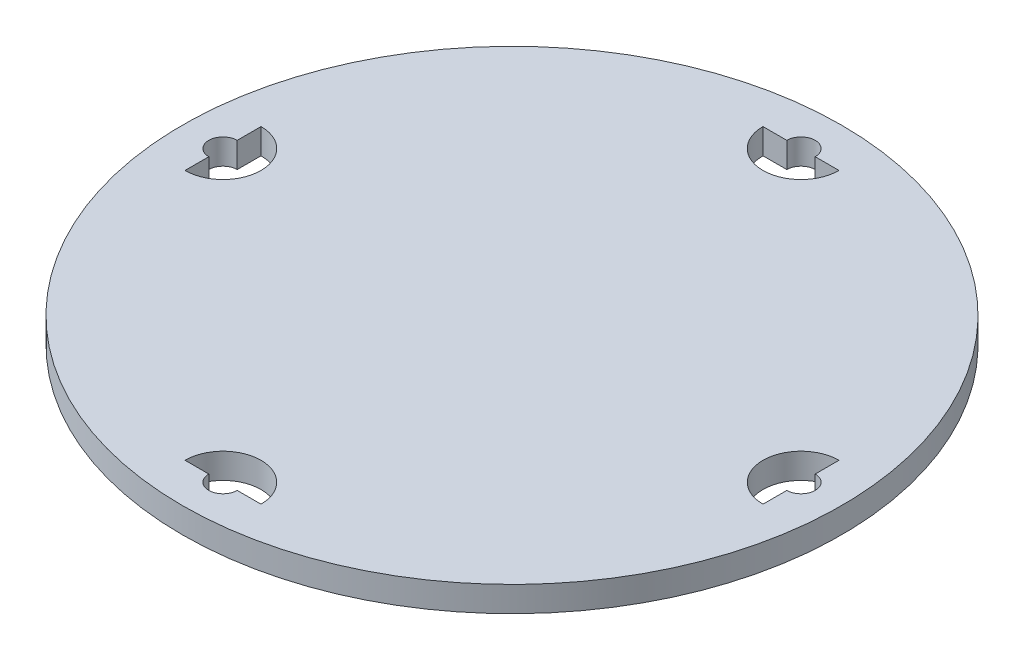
from build123d import *

# Parameters (mm, degrees)
SKETCH2_R           = 82.55
BOSS_EXTRUDE1_DEPTH = 6.35
CUT_EXTRUDE2_REACH  = 118.916
CIRPATTERN1_COUNT   = 4


with BuildPart() as part:
    # Sketch2 → Boss-Extrude1 (new body)
    with BuildSketch(Plane(origin=(0, 0, 0), x_dir=(1, 0, 0), z_dir=(0, 1, 0))):
        with Locations(Location((0, 0, 0), (0, 0, 270))):
            Circle(SKETCH2_R)
    extrude(amount=BOSS_EXTRUDE1_DEPTH)

    # Sketch3 → Cut-Extrude2 (cut, up to next)
    with BuildSketch(Plane(origin=(0, 0, 0), x_dir=(1, 0, 0), z_dir=(0, 1, 0)), mode=Mode.PRIVATE) as cut_extrude2_sk1:
        with BuildLine():
            Line((-9.525, -72.39), (-3.556, -72.39))
            ThreePointArc((-3.556, -72.39), (0, -75.946), (3.556, -72.39))
            Line((3.556, -72.39), (9.525, -72.39))
            ThreePointArc((9.525, -72.39), (0, -62.865), (-9.525, -72.39))
        make_face()
    cut_extrude2_tool1 = extrude(cut_extrude2_sk1.sketch, amount=CUT_EXTRUDE2_REACH, mode=Mode.PRIVATE) & part.part
    cut_extrude2 = cut_extrude2_tool1.solids().sort_by_distance((0, 0, 69.026599))[0]
    add(cut_extrude2, mode=Mode.SUBTRACT)

    # CirPattern1: Cut-Extrude2 ×4 about axis
    cirpattern1_axis = Axis((0, 0, 0), (0, 1, 0))
    for i in range(1, CIRPATTERN1_COUNT):
        add(cut_extrude2.rotate(cirpattern1_axis, i * 360 / CIRPATTERN1_COUNT), mode=Mode.SUBTRACT)


solid = part.part
